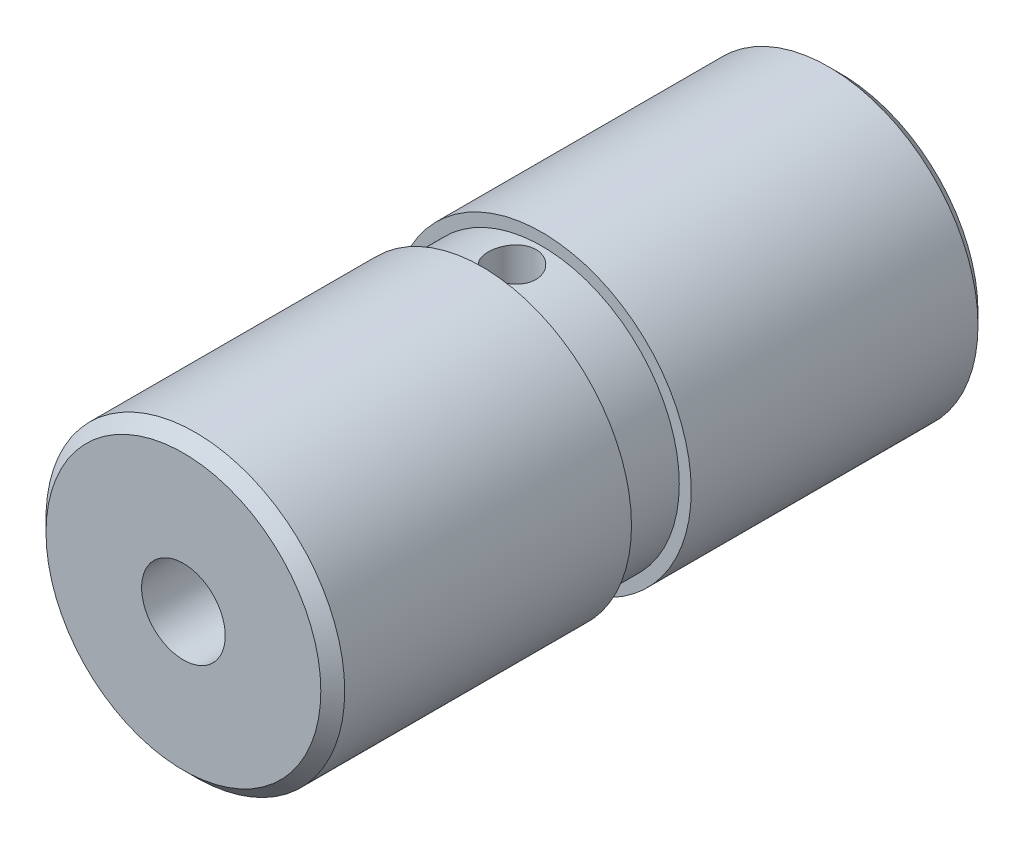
ISO-10303-21;
HEADER;
FILE_DESCRIPTION(('STEP AP214'),'2;1');
FILE_NAME('part.step','',(''),(''),'','','');
FILE_SCHEMA(('AUTOMOTIVE_DESIGN { 1 0 10303 214 1 1 1 1 }'));
ENDSEC;
DATA;
#1=APPLICATION_CONTEXT('core data for automotive mechanical design processes');
#2=APPLICATION_PROTOCOL_DEFINITION('international standard','automotive_design',2000,#1);
#3=PRODUCT_CONTEXT('',#1,'mechanical');
#4=PRODUCT('Part','Part','',(#3));
#5=PRODUCT_RELATED_PRODUCT_CATEGORY('part','',(#4));
#6=PRODUCT_DEFINITION_FORMATION('','',#4);
#7=PRODUCT_DEFINITION_CONTEXT('part definition',#1,'design');
#8=PRODUCT_DEFINITION('design','',#6,#7);
#9=PRODUCT_DEFINITION_SHAPE('','',#8);
#10=(LENGTH_UNIT() NAMED_UNIT(*) SI_UNIT(.MILLI.,.METRE.));
#11=(NAMED_UNIT(*) PLANE_ANGLE_UNIT() SI_UNIT($,.RADIAN.));
#12=(NAMED_UNIT(*) SI_UNIT($,.STERADIAN.) SOLID_ANGLE_UNIT());
#13=UNCERTAINTY_MEASURE_WITH_UNIT(LENGTH_MEASURE(1.E-05),#10,'distance_accuracy_value','');
#14=(GEOMETRIC_REPRESENTATION_CONTEXT(3) GLOBAL_UNCERTAINTY_ASSIGNED_CONTEXT((#13)) GLOBAL_UNIT_ASSIGNED_CONTEXT((#10,
#11,#12)) REPRESENTATION_CONTEXT('',''));
#15=CARTESIAN_POINT('',(0.,0.,0.));
#16=DIRECTION('',(0.,0.,1.));
#17=DIRECTION('',(1.,0.,0.));
#18=AXIS2_PLACEMENT_3D('',#15,#16,#17);
#19=CARTESIAN_POINT('',(0.,0.,55.));
#20=DIRECTION('',(0.,0.,-1.));
#21=DIRECTION('',(-1.,0.,0.));
#22=AXIS2_PLACEMENT_3D('',#19,#20,#21);
#23=CYLINDRICAL_SURFACE('',#22,12.5);
#24=CARTESIAN_POINT('',(0.,0.,30.));
#25=DIRECTION('',(0.,0.,1.));
#26=DIRECTION('',(1.,0.,0.));
#27=AXIS2_PLACEMENT_3D('',#24,#25,#26);
#28=CIRCLE('',#27,12.5);
#29=CARTESIAN_POINT('',(12.5,0.,30.));
#30=VERTEX_POINT('',#29);
#31=EDGE_CURVE('E269',#30,#30,#28,.T.);
#32=ORIENTED_EDGE('',*,*,#31,.T.);
#33=EDGE_LOOP('',(#32));
#34=FACE_BOUND('',#33,.T.);
#35=CARTESIAN_POINT('',(0.,0.,54.));
#36=DIRECTION('',(0.,0.,1.));
#37=DIRECTION('',(1.,0.,0.));
#38=AXIS2_PLACEMENT_3D('',#35,#36,#37);
#39=CIRCLE('',#38,12.5);
#40=CARTESIAN_POINT('',(12.5,0.,54.));
#41=VERTEX_POINT('',#40);
#42=EDGE_CURVE('E84',#41,#41,#39,.F.);
#43=ORIENTED_EDGE('',*,*,#42,.T.);
#44=EDGE_LOOP('',(#43));
#45=FACE_BOUND('',#44,.T.);
#46=ADVANCED_FACE('F38',(#34,#45),#23,.T.);
#47=CARTESIAN_POINT('',(0.,0.,25.));
#48=DIRECTION('',(0.,0.,1.));
#49=DIRECTION('',(1.,0.,0.));
#50=AXIS2_PLACEMENT_3D('',#47,#48,#49);
#51=CIRCLE('',#50,12.5);
#52=CARTESIAN_POINT('',(12.5,0.,25.));
#53=VERTEX_POINT('',#52);
#54=EDGE_CURVE('E268',#53,#53,#51,.T.);
#55=ORIENTED_EDGE('',*,*,#54,.F.);
#56=EDGE_LOOP('',(#55));
#57=FACE_BOUND('',#56,.T.);
#58=CARTESIAN_POINT('',(0.,0.,1.00000000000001));
#59=DIRECTION('',(0.,0.,1.));
#60=DIRECTION('',(1.,0.,0.));
#61=AXIS2_PLACEMENT_3D('',#58,#59,#60);
#62=CIRCLE('',#61,12.5);
#63=CARTESIAN_POINT('',(12.5,0.,1.00000000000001));
#64=VERTEX_POINT('',#63);
#65=EDGE_CURVE('E87',#64,#64,#62,.T.);
#66=ORIENTED_EDGE('',*,*,#65,.T.);
#67=EDGE_LOOP('',(#66));
#68=FACE_BOUND('',#67,.T.);
#69=ADVANCED_FACE('F113',(#57,#68),#23,.T.);
#70=CARTESIAN_POINT('',(0.,0.,55.));
#71=DIRECTION('',(0.,0.,1.));
#72=DIRECTION('',(1.,0.,0.));
#73=AXIS2_PLACEMENT_3D('',#70,#71,#72);
#74=PLANE('',#73);
#75=CARTESIAN_POINT('',(0.,0.,55.));
#76=DIRECTION('',(0.,0.,1.));
#77=DIRECTION('',(1.,0.,0.));
#78=AXIS2_PLACEMENT_3D('',#75,#76,#77);
#79=CIRCLE('',#78,3.49999999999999);
#80=CARTESIAN_POINT('',(3.49999999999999,0.,55.));
#81=VERTEX_POINT('',#80);
#82=EDGE_CURVE('E70',#81,#81,#79,.T.);
#83=ORIENTED_EDGE('',*,*,#82,.F.);
#84=EDGE_LOOP('',(#83));
#85=FACE_BOUND('',#84,.T.);
#86=CARTESIAN_POINT('',(0.,0.,55.));
#87=DIRECTION('',(0.,0.,1.));
#88=DIRECTION('',(1.,0.,0.));
#89=AXIS2_PLACEMENT_3D('',#86,#87,#88);
#90=CIRCLE('',#89,11.5);
#91=CARTESIAN_POINT('',(11.5,0.,55.));
#92=VERTEX_POINT('',#91);
#93=EDGE_CURVE('E11',#92,#92,#90,.T.);
#94=ORIENTED_EDGE('',*,*,#93,.T.);
#95=EDGE_LOOP('',(#94));
#96=FACE_BOUND('',#95,.T.);
#97=ADVANCED_FACE('F119',(#85,#96),#74,.T.);
#98=CARTESIAN_POINT('',(0.,0.,0.));
#99=DIRECTION('',(0.,0.,1.));
#100=DIRECTION('',(1.,0.,0.));
#101=AXIS2_PLACEMENT_3D('',#98,#99,#100);
#102=PLANE('',#101);
#103=CARTESIAN_POINT('',(0.,0.,0.));
#104=DIRECTION('',(0.,0.,-1.));
#105=DIRECTION('',(-1.,0.,0.));
#106=AXIS2_PLACEMENT_3D('',#103,#104,#105);
#107=CIRCLE('',#106,3.49999999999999);
#108=CARTESIAN_POINT('',(-3.49999999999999,0.,0.));
#109=VERTEX_POINT('',#108);
#110=EDGE_CURVE('E80',#109,#109,#107,.T.);
#111=ORIENTED_EDGE('',*,*,#110,.F.);
#112=EDGE_LOOP('',(#111));
#113=FACE_BOUND('',#112,.T.);
#114=CARTESIAN_POINT('',(0.,0.,0.));
#115=DIRECTION('',(0.,0.,1.));
#116=DIRECTION('',(1.,0.,0.));
#117=AXIS2_PLACEMENT_3D('',#114,#115,#116);
#118=CIRCLE('',#117,11.5);
#119=CARTESIAN_POINT('',(11.5,0.,0.));
#120=VERTEX_POINT('',#119);
#121=EDGE_CURVE('E52',#120,#120,#118,.F.);
#122=ORIENTED_EDGE('',*,*,#121,.T.);
#123=EDGE_LOOP('',(#122));
#124=FACE_BOUND('',#123,.T.);
#125=ADVANCED_FACE('F124',(#113,#124),#102,.F.);
#126=CARTESIAN_POINT('',(0.,0.,1.00000000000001));
#127=DIRECTION('',(0.,0.,1.));
#128=DIRECTION('',(1.,0.,0.));
#129=AXIS2_PLACEMENT_3D('',#126,#127,#128);
#130=CONICAL_SURFACE('',#129,12.5,0.78539816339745);
#131=ORIENTED_EDGE('',*,*,#121,.F.);
#132=EDGE_LOOP('',(#131));
#133=FACE_BOUND('',#132,.T.);
#134=ORIENTED_EDGE('',*,*,#65,.F.);
#135=EDGE_LOOP('',(#134));
#136=FACE_BOUND('',#135,.T.);
#137=ADVANCED_FACE('F126',(#133,#136),#130,.T.);
#138=CARTESIAN_POINT('',(0.,0.,55.));
#139=DIRECTION('',(0.,0.,-1.));
#140=DIRECTION('',(-1.,0.,0.));
#141=AXIS2_PLACEMENT_3D('',#138,#139,#140);
#142=CONICAL_SURFACE('',#141,11.5,0.785398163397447);
#143=ORIENTED_EDGE('',*,*,#42,.F.);
#144=EDGE_LOOP('',(#143));
#145=FACE_BOUND('',#144,.T.);
#146=ORIENTED_EDGE('',*,*,#93,.F.);
#147=EDGE_LOOP('',(#146));
#148=FACE_BOUND('',#147,.T.);
#149=ADVANCED_FACE('F40',(#145,#148),#142,.T.);
#150=CARTESIAN_POINT('',(0.,0.,0.));
#151=DIRECTION('',(0.,0.,-1.));
#152=DIRECTION('',(-1.,0.,0.));
#153=AXIS2_PLACEMENT_3D('',#150,#151,#152);
#154=CYLINDRICAL_SURFACE('',#153,1.99999999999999);
#155=CARTESIAN_POINT('',(0.,0.,27.5));
#156=DIRECTION('',(0.,0.707106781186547,-0.707106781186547));
#157=DIRECTION('',(0.,-0.707106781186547,-0.707106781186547));
#158=AXIS2_PLACEMENT_3D('',#155,#156,#157);
#159=ELLIPSE('',#158,2.82842712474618,1.99999999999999);
#160=CARTESIAN_POINT('',(-1.99999999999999,0.,27.5));
#161=VERTEX_POINT('',#160);
#162=CARTESIAN_POINT('',(1.99999999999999,0.,27.5));
#163=VERTEX_POINT('',#162);
#164=EDGE_CURVE('E61',#161,#163,#159,.T.);
#165=ORIENTED_EDGE('',*,*,#164,.T.);
#166=CARTESIAN_POINT('',(0.,0.,27.5));
#167=DIRECTION('',(0.,-0.707106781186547,-0.707106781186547));
#168=DIRECTION('',(0.,0.707106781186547,-0.707106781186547));
#169=AXIS2_PLACEMENT_3D('',#166,#167,#168);
#170=ELLIPSE('',#169,2.82842712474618,1.99999999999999);
#171=EDGE_CURVE('E59',#163,#161,#170,.F.);
#172=ORIENTED_EDGE('',*,*,#171,.T.);
#173=EDGE_LOOP('',(#165,#172));
#174=FACE_BOUND('',#173,.T.);
#175=CARTESIAN_POINT('',(0.,0.,33.0987090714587));
#176=DIRECTION('',(0.,0.,1.));
#177=DIRECTION('',(1.,0.,0.));
#178=AXIS2_PLACEMENT_3D('',#175,#176,#177);
#179=CIRCLE('',#178,1.99999999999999);
#180=CARTESIAN_POINT('',(1.99999999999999,0.,33.0987090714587));
#181=VERTEX_POINT('',#180);
#182=EDGE_CURVE('E76',#181,#181,#179,.T.);
#183=ORIENTED_EDGE('',*,*,#182,.T.);
#184=EDGE_LOOP('',(#183));
#185=FACE_BOUND('',#184,.T.);
#186=CARTESIAN_POINT('',(0.,0.,21.9012909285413));
#187=DIRECTION('',(0.,0.,-1.));
#188=DIRECTION('',(-1.,0.,0.));
#189=AXIS2_PLACEMENT_3D('',#186,#187,#188);
#190=CIRCLE('',#189,1.99999999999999);
#191=CARTESIAN_POINT('',(-1.99999999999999,0.,21.9012909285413));
#192=VERTEX_POINT('',#191);
#193=EDGE_CURVE('E83',#192,#192,#190,.T.);
#194=ORIENTED_EDGE('',*,*,#193,.T.);
#195=EDGE_LOOP('',(#194));
#196=FACE_BOUND('',#195,.T.);
#197=ADVANCED_FACE('F65',(#174,#185,#196),#154,.F.);
#198=CARTESIAN_POINT('',(0.,0.,21.));
#199=DIRECTION('',(0.,0.,-1.));
#200=DIRECTION('',(-1.,0.,0.));
#201=AXIS2_PLACEMENT_3D('',#198,#199,#200);
#202=CONICAL_SURFACE('',#201,3.49999999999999,1.02974425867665);
#203=CARTESIAN_POINT('',(0.,0.,21.));
#204=DIRECTION('',(0.,0.,-1.));
#205=DIRECTION('',(-1.,0.,0.));
#206=AXIS2_PLACEMENT_3D('',#203,#204,#205);
#207=CIRCLE('',#206,3.49999999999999);
#208=CARTESIAN_POINT('',(-3.49999999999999,0.,21.));
#209=VERTEX_POINT('',#208);
#210=EDGE_CURVE('E77',#209,#209,#207,.T.);
#211=ORIENTED_EDGE('',*,*,#210,.T.);
#212=EDGE_LOOP('',(#211));
#213=FACE_BOUND('',#212,.T.);
#214=ORIENTED_EDGE('',*,*,#193,.F.);
#215=EDGE_LOOP('',(#214));
#216=FACE_BOUND('',#215,.T.);
#217=ADVANCED_FACE('F109',(#213,#216),#202,.F.);
#218=CARTESIAN_POINT('',(0.,0.,0.));
#219=DIRECTION('',(0.,0.,-1.));
#220=DIRECTION('',(-1.,0.,0.));
#221=AXIS2_PLACEMENT_3D('',#218,#219,#220);
#222=CYLINDRICAL_SURFACE('',#221,3.49999999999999);
#223=ORIENTED_EDGE('',*,*,#210,.F.);
#224=EDGE_LOOP('',(#223));
#225=FACE_BOUND('',#224,.T.);
#226=ORIENTED_EDGE('',*,*,#110,.T.);
#227=EDGE_LOOP('',(#226));
#228=FACE_BOUND('',#227,.T.);
#229=ADVANCED_FACE('F100',(#225,#228),#222,.F.);
#230=CARTESIAN_POINT('',(0.,0.,34.));
#231=DIRECTION('',(0.,0.,1.));
#232=DIRECTION('',(1.,0.,0.));
#233=AXIS2_PLACEMENT_3D('',#230,#231,#232);
#234=CONICAL_SURFACE('',#233,3.49999999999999,1.02974425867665);
#235=CARTESIAN_POINT('',(0.,0.,34.));
#236=DIRECTION('',(0.,0.,1.));
#237=DIRECTION('',(1.,0.,0.));
#238=AXIS2_PLACEMENT_3D('',#235,#236,#237);
#239=CIRCLE('',#238,3.49999999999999);
#240=CARTESIAN_POINT('',(3.49999999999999,0.,34.));
#241=VERTEX_POINT('',#240);
#242=EDGE_CURVE('E67',#241,#241,#239,.T.);
#243=ORIENTED_EDGE('',*,*,#242,.T.);
#244=EDGE_LOOP('',(#243));
#245=FACE_BOUND('',#244,.T.);
#246=ORIENTED_EDGE('',*,*,#182,.F.);
#247=EDGE_LOOP('',(#246));
#248=FACE_BOUND('',#247,.T.);
#249=ADVANCED_FACE('F97',(#245,#248),#234,.F.);
#250=CARTESIAN_POINT('',(0.,0.,55.));
#251=DIRECTION('',(0.,0.,1.));
#252=DIRECTION('',(1.,0.,0.));
#253=AXIS2_PLACEMENT_3D('',#250,#251,#252);
#254=CYLINDRICAL_SURFACE('',#253,3.49999999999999);
#255=ORIENTED_EDGE('',*,*,#242,.F.);
#256=EDGE_LOOP('',(#255));
#257=FACE_BOUND('',#256,.T.);
#258=ORIENTED_EDGE('',*,*,#82,.T.);
#259=EDGE_LOOP('',(#258));
#260=FACE_BOUND('',#259,.T.);
#261=ADVANCED_FACE('F99',(#257,#260),#254,.F.);
#262=CARTESIAN_POINT('',(0.,0.,27.5));
#263=DIRECTION('',(0.,-1.,0.));
#264=DIRECTION('',(0.,0.,-1.));
#265=AXIS2_PLACEMENT_3D('',#262,#263,#264);
#266=CYLINDRICAL_SURFACE('',#265,1.99999999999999);
#267=CARTESIAN_POINT('',(0.,11.5,25.5));
#268=CARTESIAN_POINT('',(-0.111439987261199,11.4999980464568,25.500004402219));
#269=CARTESIAN_POINT('',(-0.222938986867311,11.4983633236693,25.5093456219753));
#270=CARTESIAN_POINT('',(-0.442804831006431,11.4919995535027,25.546445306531));
#271=CARTESIAN_POINT('',(-0.55116878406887,11.4872677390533,25.5742202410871));
#272=CARTESIAN_POINT('',(-0.761552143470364,11.4752400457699,25.6473192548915));
#273=CARTESIAN_POINT('',(-0.863576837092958,11.4679463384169,25.6926284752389));
#274=CARTESIAN_POINT('',(-1.05856414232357,11.4515949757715,25.7994698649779));
#275=CARTESIAN_POINT('',(-1.15152768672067,11.4425375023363,25.8610003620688));
#276=CARTESIAN_POINT('',(-1.32672978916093,11.4235561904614,25.999216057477));
#277=CARTESIAN_POINT('',(-1.40886074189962,11.4136250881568,26.0760366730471));
#278=CARTESIAN_POINT('',(-1.5591362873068,11.3940708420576,26.2423605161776));
#279=CARTESIAN_POINT('',(-1.6272799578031,11.3844477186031,26.3318645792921));
#280=CARTESIAN_POINT('',(-1.74808334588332,11.366528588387,26.5217610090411));
#281=CARTESIAN_POINT('',(-1.80063562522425,11.3582419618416,26.6222226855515));
#282=CARTESIAN_POINT('',(-1.88807717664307,11.344035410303,26.8307162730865));
#283=CARTESIAN_POINT('',(-1.92296775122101,11.338115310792,26.9387476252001));
#284=CARTESIAN_POINT('',(-1.97375430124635,11.3293847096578,27.1581695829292));
#285=CARTESIAN_POINT('',(-1.98983670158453,11.3265437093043,27.2695158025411));
#286=CARTESIAN_POINT('',(-2.00312861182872,11.3242008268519,27.4933597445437));
#287=CARTESIAN_POINT('',(-2.00033957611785,11.3246986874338,27.6058573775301));
#288=CARTESIAN_POINT('',(-1.97611940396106,11.3289494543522,27.8274733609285));
#289=CARTESIAN_POINT('',(-1.95489854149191,11.332665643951,27.9366154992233));
#290=CARTESIAN_POINT('',(-1.89474747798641,11.3428768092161,28.1497663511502));
#291=CARTESIAN_POINT('',(-1.85581662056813,11.3493718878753,28.2537748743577));
#292=CARTESIAN_POINT('',(-1.76114002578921,11.364448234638,28.4543307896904));
#293=CARTESIAN_POINT('',(-1.70530778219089,11.3730401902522,28.5508365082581));
#294=CARTESIAN_POINT('',(-1.57847462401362,11.3913348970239,28.7331891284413));
#295=CARTESIAN_POINT('',(-1.50747237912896,11.4010377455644,28.8190350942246));
#296=CARTESIAN_POINT('',(-1.35117304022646,11.4206218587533,28.9788477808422));
#297=CARTESIAN_POINT('',(-1.26569571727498,11.4305037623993,29.0526382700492));
#298=CARTESIAN_POINT('',(-1.08347997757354,11.4492115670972,29.1848566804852));
#299=CARTESIAN_POINT('',(-0.986741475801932,11.4580374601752,29.2432844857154));
#300=CARTESIAN_POINT('',(-0.784577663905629,11.4736530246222,29.3431383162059));
#301=CARTESIAN_POINT('',(-0.679144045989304,11.4804407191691,29.3845478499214));
#302=CARTESIAN_POINT('',(-0.462673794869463,11.4911994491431,29.4490212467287));
#303=CARTESIAN_POINT('',(-0.351637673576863,11.4951707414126,29.4720867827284));
#304=CARTESIAN_POINT('',(-0.128632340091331,11.4998144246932,29.4989763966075));
#305=CARTESIAN_POINT('',(-0.0166931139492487,11.5005282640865,29.5030422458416));
#306=CARTESIAN_POINT('',(0.206266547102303,11.4986904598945,29.4924629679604));
#307=CARTESIAN_POINT('',(0.317287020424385,11.4961389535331,29.4778186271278));
#308=CARTESIAN_POINT('',(0.53450419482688,11.4880828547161,29.430435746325));
#309=CARTESIAN_POINT('',(0.640727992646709,11.4825979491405,29.3978177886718));
#310=CARTESIAN_POINT('',(0.846199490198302,11.469287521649,29.3155427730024));
#311=CARTESIAN_POINT('',(0.945446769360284,11.461461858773,29.2658846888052));
#312=CARTESIAN_POINT('',(1.13519201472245,11.4442348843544,29.1503915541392));
#313=CARTESIAN_POINT('',(1.22559739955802,11.4348192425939,29.0844065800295));
#314=CARTESIAN_POINT('',(1.39413850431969,11.4154976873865,28.9383378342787));
#315=CARTESIAN_POINT('',(1.47227324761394,11.4055917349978,28.8582529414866));
#316=CARTESIAN_POINT('',(1.61495889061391,11.3862708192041,28.6851698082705));
#317=CARTESIAN_POINT('',(1.67934587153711,11.376862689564,28.5920355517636));
#318=CARTESIAN_POINT('',(1.79156091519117,11.3597334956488,28.39613095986));
#319=CARTESIAN_POINT('',(1.83938953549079,11.3520123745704,28.2933609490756));
#320=CARTESIAN_POINT('',(1.91688925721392,11.3391834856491,28.0815462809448));
#321=CARTESIAN_POINT('',(1.94663977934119,11.3340643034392,27.9725314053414));
#322=CARTESIAN_POINT('',(1.98738717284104,11.3269910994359,27.7509545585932));
#323=CARTESIAN_POINT('',(1.99838583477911,11.3250367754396,27.6383929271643));
#324=CARTESIAN_POINT('',(2.00126398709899,11.3245283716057,27.414556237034));
#325=CARTESIAN_POINT('',(1.99340166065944,11.3259283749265,27.3032845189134));
#326=CARTESIAN_POINT('',(1.95934163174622,11.3318698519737,27.0836735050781));
#327=CARTESIAN_POINT('',(1.93314400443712,11.3364113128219,26.9753341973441));
#328=CARTESIAN_POINT('',(1.86325935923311,11.3481059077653,26.7647763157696));
#329=CARTESIAN_POINT('',(1.81959649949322,11.3552554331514,26.66254951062));
#330=CARTESIAN_POINT('',(1.71604786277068,11.3713637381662,26.4668305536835));
#331=CARTESIAN_POINT('',(1.65616116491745,11.3803226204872,26.373338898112));
#332=CARTESIAN_POINT('',(1.52095132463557,11.3991847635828,26.1964433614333));
#333=CARTESIAN_POINT('',(1.44543890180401,11.409098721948,26.1131852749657));
#334=CARTESIAN_POINT('',(1.28151898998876,11.4286704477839,25.9604345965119));
#335=CARTESIAN_POINT('',(1.19310853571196,11.438328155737,25.8909451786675));
#336=CARTESIAN_POINT('',(1.0051021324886,11.4563845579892,25.7672184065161));
#337=CARTESIAN_POINT('',(0.905426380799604,11.4647731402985,25.7131008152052));
#338=CARTESIAN_POINT('',(0.698290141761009,11.4792477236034,25.6224628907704));
#339=CARTESIAN_POINT('',(0.590837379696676,11.4853359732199,25.5859253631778));
#340=CARTESIAN_POINT('',(0.402499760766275,11.4932243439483,25.5392451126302));
#341=CARTESIAN_POINT('',(0.32274213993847,11.4957513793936,25.5245522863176));
#342=CARTESIAN_POINT('',(0.162000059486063,11.499139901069,25.5049282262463));
#343=CARTESIAN_POINT('',(0.0810156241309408,11.5000014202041,25.499996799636));
#344=CARTESIAN_POINT('',(0.,11.5,25.5));
#345=B_SPLINE_CURVE_WITH_KNOTS('',3,(#267,#268,#269,#270,#271,#272,#273,#274,#275,#276,#277,
#278,#279,#280,#281,#282,#283,#284,#285,#286,#287,#288,#289,#290,#291,#292,#293,#294,#295,#296,
#297,#298,#299,#300,#301,#302,#303,#304,#305,#306,#307,#308,#309,#310,#311,#312,#313,#314,#315,
#316,#317,#318,#319,#320,#321,#322,#323,#324,#325,#326,#327,#328,#329,#330,#331,#332,#333,#334,
#335,#336,#337,#338,#339,#340,#341,#342,#343,#344),.UNSPECIFIED.,.T.,.F.,(4,2,2,2,2,2,2,2,2,2,2,
2,2,2,2,2,2,2,2,2,2,2,2,2,2,2,2,2,2,2,2,2,2,2,2,2,2,2,4),(0.,0.334023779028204,
0.668346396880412,1.002386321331,1.33639182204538,1.67349881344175,2.0106280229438,
2.35002908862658,2.68940512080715,3.02538798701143,3.36134495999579,3.69351887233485,
4.02570509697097,4.35962115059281,4.69356649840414,5.03202519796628,5.37048645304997,
5.70927492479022,6.04803249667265,6.38246741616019,6.71688828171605,7.04909241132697,
7.38131655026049,7.71671261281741,8.05213535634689,8.39135808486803,8.73056938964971,
9.06827948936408,9.40595734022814,9.73903924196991,10.0721197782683,10.4047411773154,
10.7373814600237,11.0743155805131,11.4113272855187,11.7508968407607,12.0901335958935,
12.3329699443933,12.5758014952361),.UNSPECIFIED.);
#346=CARTESIAN_POINT('',(0.,11.5,25.5));
#347=VERTEX_POINT('',#346);
#348=EDGE_CURVE('E42',#347,#347,#345,.T.);
#349=ORIENTED_EDGE('',*,*,#348,.T.);
#350=EDGE_LOOP('',(#349));
#351=FACE_BOUND('',#350,.T.);
#352=ORIENTED_EDGE('',*,*,#164,.F.);
#353=ORIENTED_EDGE('',*,*,#171,.F.);
#354=EDGE_LOOP('',(#352,#353));
#355=FACE_BOUND('',#354,.T.);
#356=ADVANCED_FACE('F62',(#351,#355),#266,.F.);
#357=CARTESIAN_POINT('',(0.,0.,54.));
#358=DIRECTION('',(0.,0.,1.));
#359=DIRECTION('',(1.,0.,0.));
#360=AXIS2_PLACEMENT_3D('',#357,#358,#359);
#361=CYLINDRICAL_SURFACE('',#360,11.5);
#362=CARTESIAN_POINT('',(0.,0.,25.));
#363=DIRECTION('',(0.,0.,1.));
#364=DIRECTION('',(1.,0.,0.));
#365=AXIS2_PLACEMENT_3D('',#362,#363,#364);
#366=CIRCLE('',#365,11.5);
#367=CARTESIAN_POINT('',(11.5,0.,25.));
#368=VERTEX_POINT('',#367);
#369=EDGE_CURVE('E265',#368,#368,#366,.T.);
#370=ORIENTED_EDGE('',*,*,#369,.T.);
#371=EDGE_LOOP('',(#370));
#372=FACE_BOUND('',#371,.T.);
#373=CARTESIAN_POINT('',(0.,0.,30.));
#374=DIRECTION('',(0.,0.,1.));
#375=DIRECTION('',(1.,0.,0.));
#376=AXIS2_PLACEMENT_3D('',#373,#374,#375);
#377=CIRCLE('',#376,11.5);
#378=CARTESIAN_POINT('',(11.5,0.,30.));
#379=VERTEX_POINT('',#378);
#380=EDGE_CURVE('E271',#379,#379,#377,.T.);
#381=ORIENTED_EDGE('',*,*,#380,.F.);
#382=EDGE_LOOP('',(#381));
#383=FACE_BOUND('',#382,.T.);
#384=ORIENTED_EDGE('',*,*,#348,.F.);
#385=EDGE_LOOP('',(#384));
#386=FACE_BOUND('',#385,.T.);
#387=ADVANCED_FACE('F181',(#372,#383,#386),#361,.T.);
#388=CARTESIAN_POINT('',(0.,-12.5,30.));
#389=DIRECTION('',(0.,0.,1.));
#390=DIRECTION('',(1.,0.,0.));
#391=AXIS2_PLACEMENT_3D('',#388,#389,#390);
#392=PLANE('',#391);
#393=ORIENTED_EDGE('',*,*,#31,.F.);
#394=EDGE_LOOP('',(#393));
#395=FACE_BOUND('',#394,.T.);
#396=ORIENTED_EDGE('',*,*,#380,.T.);
#397=EDGE_LOOP('',(#396));
#398=FACE_BOUND('',#397,.T.);
#399=ADVANCED_FACE('F189',(#395,#398),#392,.F.);
#400=CARTESIAN_POINT('',(0.,-12.5,25.));
#401=DIRECTION('',(0.,0.,-1.));
#402=DIRECTION('',(-1.,0.,0.));
#403=AXIS2_PLACEMENT_3D('',#400,#401,#402);
#404=PLANE('',#403);
#405=ORIENTED_EDGE('',*,*,#369,.F.);
#406=EDGE_LOOP('',(#405));
#407=FACE_BOUND('',#406,.T.);
#408=ORIENTED_EDGE('',*,*,#54,.T.);
#409=EDGE_LOOP('',(#408));
#410=FACE_BOUND('',#409,.T.);
#411=ADVANCED_FACE('F196',(#407,#410),#404,.F.);
#412=CLOSED_SHELL('',(#46,#69,#97,#125,#137,#149,#197,#217,#229,#249,#261,#356,#387,#399,#411));
#413=MANIFOLD_SOLID_BREP('B2',#412);
#414=ADVANCED_BREP_SHAPE_REPRESENTATION('',(#18,#413),#14);
#415=SHAPE_DEFINITION_REPRESENTATION(#9,#414);
ENDSEC;
END-ISO-10303-21;
